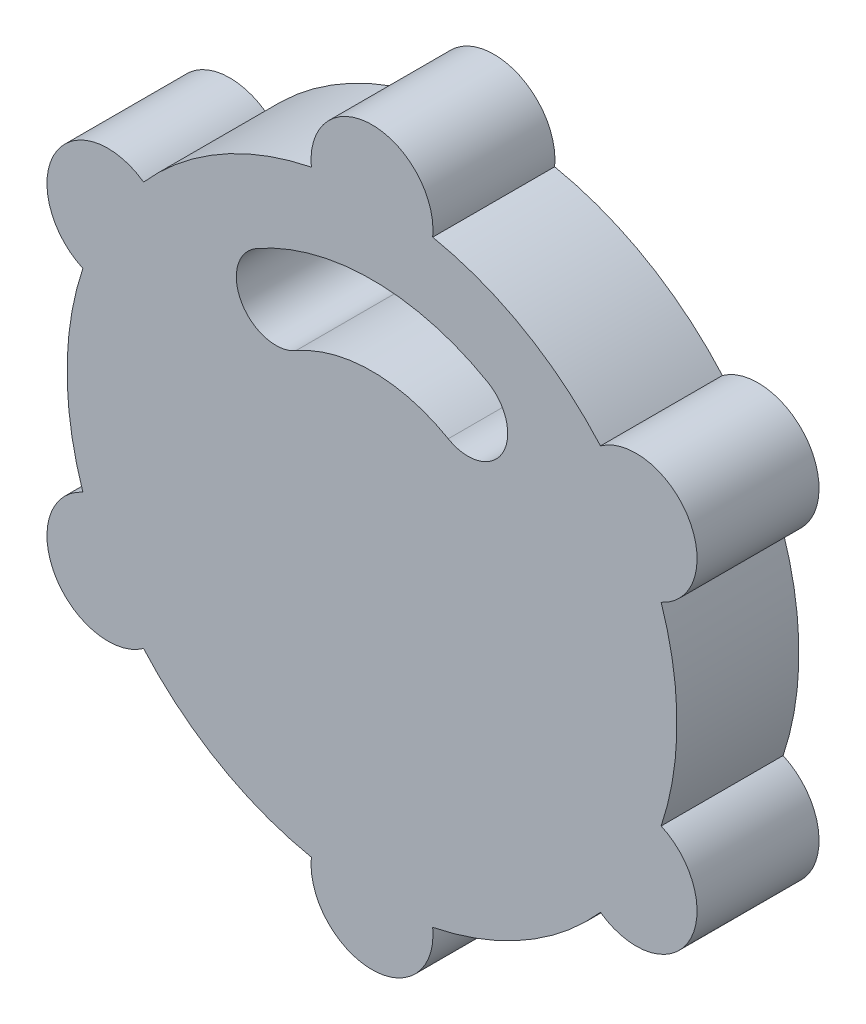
from build123d import *

# Parameters (mm, degrees)
BASE_EXTRUDE_DEPTH = 20
CUT_EXTRUDE2_DEPTH = 83.710491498


with BuildPart() as part:
    # Sketch1 → Base-Extrude (new body)
    with BuildSketch(Plane(origin=(0, 0, 0), x_dir=(0.8660254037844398, 0.49999999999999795, 0), z_dir=(0, 0, 1))):
        with BuildLine():
            ThreePointArc((49, 9.949874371), (43.301270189, 25), (33.11684397, 37.4603076))
            ThreePointArc((33.11684397, 37.4603076), (30, 51.961524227), (15.88315603, 47.410181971))
            ThreePointArc((15.88315603, 47.410181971), (0, 50), (-15.88315603, 47.410181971))
            ThreePointArc((-15.88315603, 47.410181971), (-30, 51.961524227), (-33.11684397, 37.4603076))
            ThreePointArc((-33.11684397, 37.4603076), (-43.301270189, 25), (-49, 9.949874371))
            ThreePointArc((-49, 9.949874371), (-60, 0), (-49, -9.949874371))
            ThreePointArc((-49, -9.949874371), (-43.301270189, -25), (-33.11684397, -37.4603076))
            ThreePointArc((-33.11684397, -37.4603076), (-30, -51.961524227), (-15.88315603, -47.410181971))
            ThreePointArc((-15.88315603, -47.410181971), (0, -50), (15.88315603, -47.410181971))
            ThreePointArc((15.88315603, -47.410181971), (30, -51.961524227), (33.11684397, -37.4603076))
            ThreePointArc((33.11684397, -37.4603076), (43.301270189, -25), (49, -9.949874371))
            ThreePointArc((49, -9.949874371), (60, 0), (49, 9.949874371))
        make_face()
    extrude(amount=BASE_EXTRUDE_DEPTH)

    # Sketch2 → Cut-Extrude2 (cut, through all)
    with BuildSketch(Plane.XY.offset(20)):
        with BuildLine():
            ThreePointArc((-19, 32.908965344), (-21.379165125, 24.029800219), (-12.5, 21.650635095))
            ThreePointArc((-12.5, 21.650635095), (0, 25), (12.5, 21.650635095))
            ThreePointArc((12.5, 21.650635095), (21.379165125, 24.029800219), (19, 32.908965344))
            ThreePointArc((19, 32.908965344), (0, 38), (-19, 32.908965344))
        make_face()
    extrude(amount=-CUT_EXTRUDE2_DEPTH, mode=Mode.SUBTRACT)


solid = part.part
